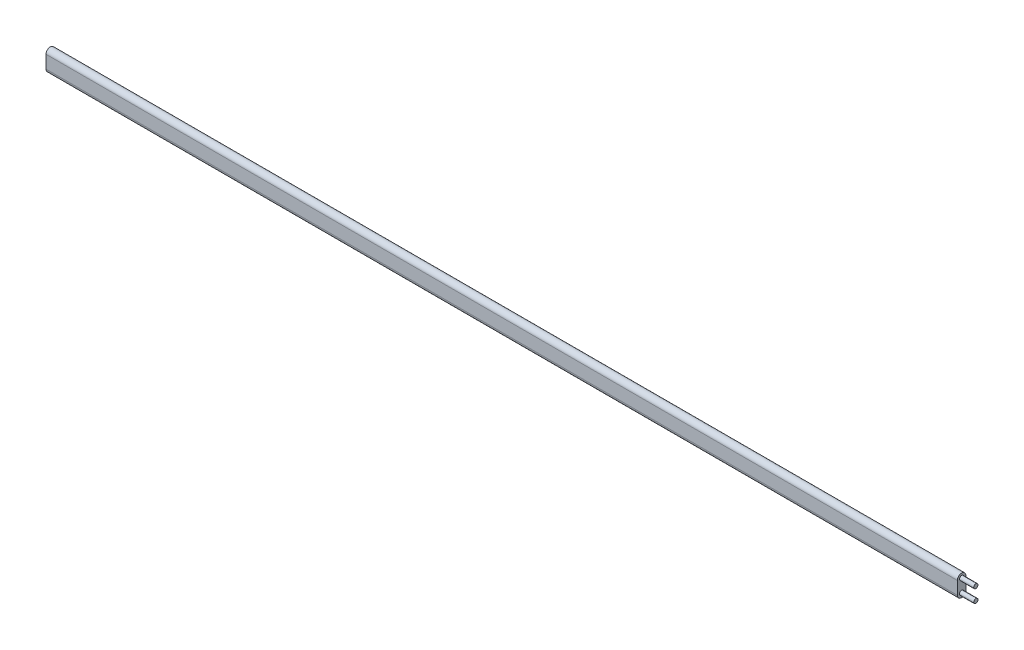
ISO-10303-21;
HEADER;
FILE_DESCRIPTION(('STEP AP214'),'2;1');
FILE_NAME('part.step','',(''),(''),'','','');
FILE_SCHEMA(('AUTOMOTIVE_DESIGN { 1 0 10303 214 1 1 1 1 }'));
ENDSEC;
DATA;
#1=APPLICATION_CONTEXT('core data for automotive mechanical design processes');
#2=APPLICATION_PROTOCOL_DEFINITION('international standard','automotive_design',2000,#1);
#3=PRODUCT_CONTEXT('',#1,'mechanical');
#4=PRODUCT('Part','Part','',(#3));
#5=PRODUCT_RELATED_PRODUCT_CATEGORY('part','',(#4));
#6=PRODUCT_DEFINITION_FORMATION('','',#4);
#7=PRODUCT_DEFINITION_CONTEXT('part definition',#1,'design');
#8=PRODUCT_DEFINITION('design','',#6,#7);
#9=PRODUCT_DEFINITION_SHAPE('','',#8);
#10=(LENGTH_UNIT() NAMED_UNIT(*) SI_UNIT(.MILLI.,.METRE.));
#11=(NAMED_UNIT(*) PLANE_ANGLE_UNIT() SI_UNIT($,.RADIAN.));
#12=(NAMED_UNIT(*) SI_UNIT($,.STERADIAN.) SOLID_ANGLE_UNIT());
#13=UNCERTAINTY_MEASURE_WITH_UNIT(LENGTH_MEASURE(1.E-05),#10,'distance_accuracy_value','');
#14=(GEOMETRIC_REPRESENTATION_CONTEXT(3) GLOBAL_UNCERTAINTY_ASSIGNED_CONTEXT((#13)) GLOBAL_UNIT_ASSIGNED_CONTEXT((#10,
#11,#12)) REPRESENTATION_CONTEXT('',''));
#15=CARTESIAN_POINT('',(0.,0.,0.));
#16=DIRECTION('',(0.,0.,1.));
#17=DIRECTION('',(1.,0.,0.));
#18=AXIS2_PLACEMENT_3D('',#15,#16,#17);
#19=CARTESIAN_POINT('',(0.,-4.5,0.));
#20=DIRECTION('',(-1.,0.,0.));
#21=DIRECTION('',(0.,0.,1.));
#22=AXIS2_PLACEMENT_3D('',#19,#20,#21);
#23=PLANE('',#22);
#24=CARTESIAN_POINT('',(0.,4.5,0.));
#25=DIRECTION('',(-1.,0.,0.));
#26=DIRECTION('',(0.,0.,1.));
#27=AXIS2_PLACEMENT_3D('',#24,#25,#26);
#28=CIRCLE('',#27,1.5);
#29=CARTESIAN_POINT('',(0.,4.5,1.5));
#30=VERTEX_POINT('',#29);
#31=EDGE_CURVE('E47',#30,#30,#28,.F.);
#32=ORIENTED_EDGE('',*,*,#31,.F.);
#33=EDGE_LOOP('',(#32));
#34=FACE_BOUND('',#33,.T.);
#35=CARTESIAN_POINT('',(0.,-4.5,0.));
#36=DIRECTION('',(1.,0.,0.));
#37=DIRECTION('',(0.,0.,1.));
#38=AXIS2_PLACEMENT_3D('',#35,#36,#37);
#39=CIRCLE('',#38,3.);
#40=CARTESIAN_POINT('',(0.,-4.5,3.));
#41=VERTEX_POINT('',#40);
#42=CARTESIAN_POINT('',(0.,-4.5,-3.));
#43=VERTEX_POINT('',#42);
#44=EDGE_CURVE('E82',#41,#43,#39,.T.);
#45=ORIENTED_EDGE('',*,*,#44,.T.);
#46=DIRECTION('',(0.,1.,0.));
#47=VECTOR('',#46,1.);
#48=CARTESIAN_POINT('',(0.,4.5,-3.));
#49=LINE('',#48,#47);
#50=CARTESIAN_POINT('',(0.,4.5,-3.));
#51=VERTEX_POINT('',#50);
#52=EDGE_CURVE('E93',#43,#51,#49,.T.);
#53=ORIENTED_EDGE('',*,*,#52,.T.);
#54=CARTESIAN_POINT('',(0.,4.5,0.));
#55=DIRECTION('',(1.,0.,0.));
#56=DIRECTION('',(0.,0.,1.));
#57=AXIS2_PLACEMENT_3D('',#54,#55,#56);
#58=CIRCLE('',#57,3.);
#59=CARTESIAN_POINT('',(0.,4.5,3.));
#60=VERTEX_POINT('',#59);
#61=EDGE_CURVE('E99',#51,#60,#58,.T.);
#62=ORIENTED_EDGE('',*,*,#61,.T.);
#63=DIRECTION('',(0.,-1.,0.));
#64=VECTOR('',#63,1.);
#65=CARTESIAN_POINT('',(0.,-4.5,3.));
#66=LINE('',#65,#64);
#67=EDGE_CURVE('E102',#60,#41,#66,.T.);
#68=ORIENTED_EDGE('',*,*,#67,.T.);
#69=EDGE_LOOP('',(#45,#53,#62,#68));
#70=FACE_BOUND('',#69,.T.);
#71=CARTESIAN_POINT('',(0.,-4.5,0.));
#72=DIRECTION('',(-1.,0.,0.));
#73=DIRECTION('',(0.,0.,1.));
#74=AXIS2_PLACEMENT_3D('',#71,#72,#73);
#75=CIRCLE('',#74,1.5);
#76=CARTESIAN_POINT('',(0.,-4.5,1.5));
#77=VERTEX_POINT('',#76);
#78=EDGE_CURVE('E11',#77,#77,#75,.F.);
#79=ORIENTED_EDGE('',*,*,#78,.F.);
#80=EDGE_LOOP('',(#79));
#81=FACE_BOUND('',#80,.T.);
#82=ADVANCED_FACE('F38',(#34,#70,#81),#23,.F.);
#83=CARTESIAN_POINT('',(-640.,-4.5,0.));
#84=DIRECTION('',(1.,0.,0.));
#85=DIRECTION('',(0.,0.,-1.));
#86=AXIS2_PLACEMENT_3D('',#83,#84,#85);
#87=CYLINDRICAL_SURFACE('',#86,3.);
#88=ORIENTED_EDGE('',*,*,#44,.F.);
#89=DIRECTION('',(1.,0.,0.));
#90=VECTOR('',#89,1.);
#91=CARTESIAN_POINT('',(-640.,-4.5,3.));
#92=LINE('',#91,#90);
#93=CARTESIAN_POINT('',(-640.,-4.5,3.));
#94=VERTEX_POINT('',#93);
#95=EDGE_CURVE('E54',#94,#41,#92,.T.);
#96=ORIENTED_EDGE('',*,*,#95,.F.);
#97=CARTESIAN_POINT('',(-640.,-4.5,0.));
#98=DIRECTION('',(1.,0.,0.));
#99=DIRECTION('',(0.,0.,1.));
#100=AXIS2_PLACEMENT_3D('',#97,#98,#99);
#101=CIRCLE('',#100,3.);
#102=CARTESIAN_POINT('',(-640.,-4.5,-3.));
#103=VERTEX_POINT('',#102);
#104=EDGE_CURVE('E84',#94,#103,#101,.T.);
#105=ORIENTED_EDGE('',*,*,#104,.T.);
#106=DIRECTION('',(1.,0.,0.));
#107=VECTOR('',#106,1.);
#108=CARTESIAN_POINT('',(-640.,-4.5,-3.));
#109=LINE('',#108,#107);
#110=EDGE_CURVE('E79',#103,#43,#109,.T.);
#111=ORIENTED_EDGE('',*,*,#110,.T.);
#112=EDGE_LOOP('',(#88,#96,#105,#111));
#113=FACE_BOUND('',#112,.T.);
#114=ADVANCED_FACE('F40',(#113),#87,.T.);
#115=CARTESIAN_POINT('',(-640.,-4.5,3.));
#116=DIRECTION('',(0.,0.,1.));
#117=DIRECTION('',(0.,-1.,0.));
#118=AXIS2_PLACEMENT_3D('',#115,#116,#117);
#119=PLANE('',#118);
#120=ORIENTED_EDGE('',*,*,#67,.F.);
#121=DIRECTION('',(1.,0.,0.));
#122=VECTOR('',#121,1.);
#123=CARTESIAN_POINT('',(-640.,4.5,3.));
#124=LINE('',#123,#122);
#125=CARTESIAN_POINT('',(-640.,4.5,3.));
#126=VERTEX_POINT('',#125);
#127=EDGE_CURVE('E62',#126,#60,#124,.T.);
#128=ORIENTED_EDGE('',*,*,#127,.F.);
#129=DIRECTION('',(0.,-1.,0.));
#130=VECTOR('',#129,1.);
#131=CARTESIAN_POINT('',(-640.,-4.5,3.));
#132=LINE('',#131,#130);
#133=EDGE_CURVE('E90',#126,#94,#132,.T.);
#134=ORIENTED_EDGE('',*,*,#133,.T.);
#135=ORIENTED_EDGE('',*,*,#95,.T.);
#136=EDGE_LOOP('',(#120,#128,#134,#135));
#137=FACE_BOUND('',#136,.T.);
#138=ADVANCED_FACE('F143',(#137),#119,.T.);
#139=CARTESIAN_POINT('',(-640.,4.5,0.));
#140=DIRECTION('',(1.,0.,0.));
#141=DIRECTION('',(0.,0.,-1.));
#142=AXIS2_PLACEMENT_3D('',#139,#140,#141);
#143=CYLINDRICAL_SURFACE('',#142,3.);
#144=ORIENTED_EDGE('',*,*,#61,.F.);
#145=DIRECTION('',(1.,0.,0.));
#146=VECTOR('',#145,1.);
#147=CARTESIAN_POINT('',(-640.,4.5,-3.));
#148=LINE('',#147,#146);
#149=CARTESIAN_POINT('',(-640.,4.5,-3.));
#150=VERTEX_POINT('',#149);
#151=EDGE_CURVE('E89',#150,#51,#148,.T.);
#152=ORIENTED_EDGE('',*,*,#151,.F.);
#153=CARTESIAN_POINT('',(-640.,4.5,0.));
#154=DIRECTION('',(1.,0.,0.));
#155=DIRECTION('',(0.,0.,1.));
#156=AXIS2_PLACEMENT_3D('',#153,#154,#155);
#157=CIRCLE('',#156,3.);
#158=EDGE_CURVE('E122',#150,#126,#157,.T.);
#159=ORIENTED_EDGE('',*,*,#158,.T.);
#160=ORIENTED_EDGE('',*,*,#127,.T.);
#161=EDGE_LOOP('',(#144,#152,#159,#160));
#162=FACE_BOUND('',#161,.T.);
#163=ADVANCED_FACE('F153',(#162),#143,.T.);
#164=CARTESIAN_POINT('',(-640.,4.5,-3.));
#165=DIRECTION('',(0.,0.,-1.));
#166=DIRECTION('',(0.,1.,0.));
#167=AXIS2_PLACEMENT_3D('',#164,#165,#166);
#168=PLANE('',#167);
#169=ORIENTED_EDGE('',*,*,#52,.F.);
#170=ORIENTED_EDGE('',*,*,#110,.F.);
#171=DIRECTION('',(0.,1.,0.));
#172=VECTOR('',#171,1.);
#173=CARTESIAN_POINT('',(-640.,4.5,-3.));
#174=LINE('',#173,#172);
#175=EDGE_CURVE('E119',#103,#150,#174,.T.);
#176=ORIENTED_EDGE('',*,*,#175,.T.);
#177=ORIENTED_EDGE('',*,*,#151,.T.);
#178=EDGE_LOOP('',(#169,#170,#176,#177));
#179=FACE_BOUND('',#178,.T.);
#180=ADVANCED_FACE('F94',(#179),#168,.T.);
#181=CARTESIAN_POINT('',(-640.,-4.5,0.));
#182=DIRECTION('',(-1.,0.,0.));
#183=DIRECTION('',(0.,0.,1.));
#184=AXIS2_PLACEMENT_3D('',#181,#182,#183);
#185=PLANE('',#184);
#186=ORIENTED_EDGE('',*,*,#104,.F.);
#187=ORIENTED_EDGE('',*,*,#133,.F.);
#188=ORIENTED_EDGE('',*,*,#158,.F.);
#189=ORIENTED_EDGE('',*,*,#175,.F.);
#190=EDGE_LOOP('',(#186,#187,#188,#189));
#191=FACE_BOUND('',#190,.T.);
#192=ADVANCED_FACE('F147',(#191),#185,.T.);
#193=CARTESIAN_POINT('',(10.,4.5,0.));
#194=DIRECTION('',(-1.,0.,0.));
#195=DIRECTION('',(0.,0.,1.));
#196=AXIS2_PLACEMENT_3D('',#193,#194,#195);
#197=CYLINDRICAL_SURFACE('',#196,1.5);
#198=CARTESIAN_POINT('',(10.,4.5,0.));
#199=DIRECTION('',(1.,0.,0.));
#200=DIRECTION('',(0.,0.,-1.));
#201=AXIS2_PLACEMENT_3D('',#198,#199,#200);
#202=CIRCLE('',#201,1.5);
#203=CARTESIAN_POINT('',(10.,4.5,-1.5));
#204=VERTEX_POINT('',#203);
#205=EDGE_CURVE('E104',#204,#204,#202,.T.);
#206=ORIENTED_EDGE('',*,*,#205,.F.);
#207=EDGE_LOOP('',(#206));
#208=FACE_BOUND('',#207,.T.);
#209=ORIENTED_EDGE('',*,*,#31,.T.);
#210=EDGE_LOOP('',(#209));
#211=FACE_BOUND('',#210,.T.);
#212=ADVANCED_FACE('F136',(#208,#211),#197,.T.);
#213=CARTESIAN_POINT('',(10.,4.5,0.));
#214=DIRECTION('',(1.,0.,0.));
#215=DIRECTION('',(0.,0.,-1.));
#216=AXIS2_PLACEMENT_3D('',#213,#214,#215);
#217=PLANE('',#216);
#218=ORIENTED_EDGE('',*,*,#205,.T.);
#219=EDGE_LOOP('',(#218));
#220=FACE_BOUND('',#219,.T.);
#221=ADVANCED_FACE('F169',(#220),#217,.T.);
#222=CARTESIAN_POINT('',(10.,-4.5,0.));
#223=DIRECTION('',(-1.,0.,0.));
#224=DIRECTION('',(0.,0.,1.));
#225=AXIS2_PLACEMENT_3D('',#222,#223,#224);
#226=CYLINDRICAL_SURFACE('',#225,1.5);
#227=CARTESIAN_POINT('',(10.,-4.5,0.));
#228=DIRECTION('',(1.,0.,0.));
#229=DIRECTION('',(0.,0.,-1.));
#230=AXIS2_PLACEMENT_3D('',#227,#228,#229);
#231=CIRCLE('',#230,1.5);
#232=CARTESIAN_POINT('',(10.,-4.5,-1.5));
#233=VERTEX_POINT('',#232);
#234=EDGE_CURVE('E110',#233,#233,#231,.T.);
#235=ORIENTED_EDGE('',*,*,#234,.F.);
#236=EDGE_LOOP('',(#235));
#237=FACE_BOUND('',#236,.T.);
#238=ORIENTED_EDGE('',*,*,#78,.T.);
#239=EDGE_LOOP('',(#238));
#240=FACE_BOUND('',#239,.T.);
#241=ADVANCED_FACE('F175',(#237,#240),#226,.T.);
#242=CARTESIAN_POINT('',(10.,-4.5,0.));
#243=DIRECTION('',(1.,0.,0.));
#244=DIRECTION('',(0.,0.,-1.));
#245=AXIS2_PLACEMENT_3D('',#242,#243,#244);
#246=PLANE('',#245);
#247=ORIENTED_EDGE('',*,*,#234,.T.);
#248=EDGE_LOOP('',(#247));
#249=FACE_BOUND('',#248,.T.);
#250=ADVANCED_FACE('F181',(#249),#246,.T.);
#251=CLOSED_SHELL('',(#82,#114,#138,#163,#180,#192,#212,#221,#241,#250));
#252=MANIFOLD_SOLID_BREP('B2',#251);
#253=ADVANCED_BREP_SHAPE_REPRESENTATION('',(#18,#252),#14);
#254=SHAPE_DEFINITION_REPRESENTATION(#9,#253);
ENDSEC;
END-ISO-10303-21;
